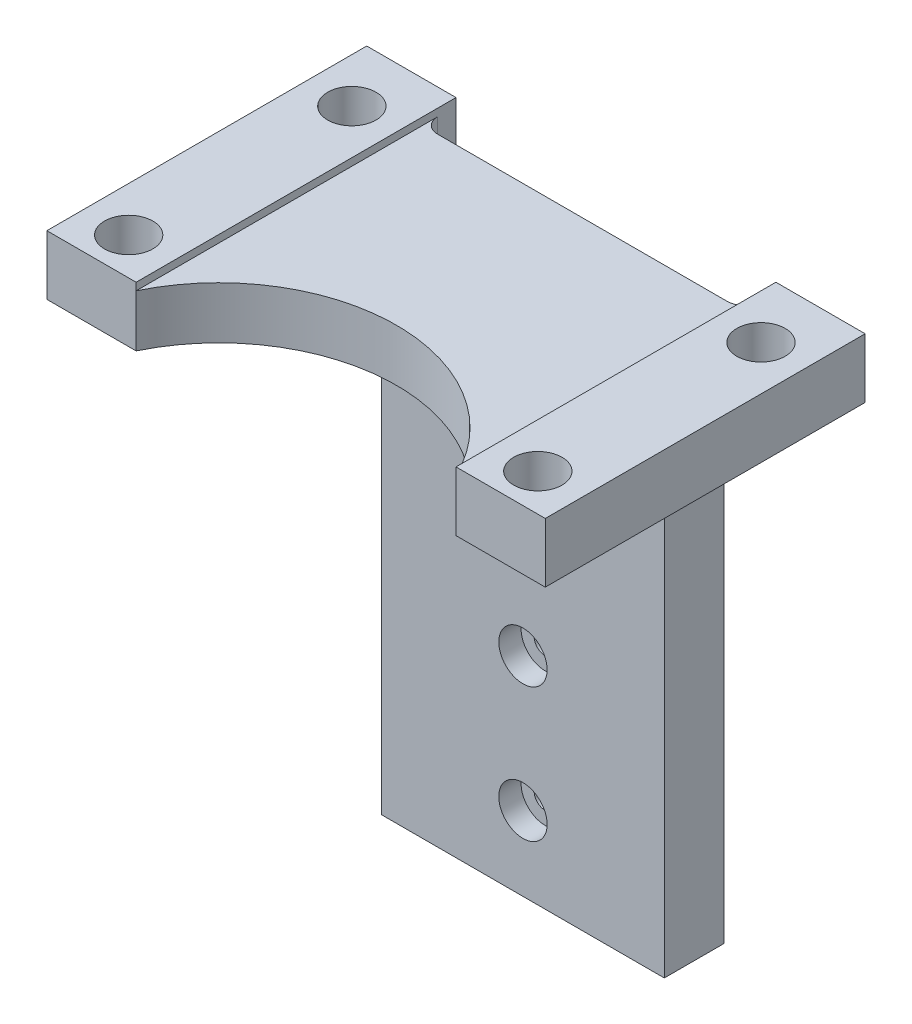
from build123d import *

# Parameters (mm, degrees)
ESQUISSE1_R             = 3.25
EXTRUSION1_DEPTH        = 8
ESQUISSE2_W             = 38
ESQUISSE2_H             = 8
EXTRUSION2_DEPTH        = 68
ESQUISSE3_R             = 3.25
ENL_V_MAT_EXTRU_1_DEPTH = 3
ESQUISSE4_R             = 1.5
ENL_V_MAT_EXTRU_2_DEPTH = 102.169412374
ESQUISSE5_W             = 43
ESQUISSE5_H             = 43
ENL_V_MAT_EXTRU_3_DEPTH = 1


with BuildPart() as part:
    # Esquisse1 → Extrusion1 (new body)
    with BuildSketch(Plane(origin=(0, 0, 0), x_dir=(1, 0, 0), z_dir=(0, 1, 0))):
        with BuildLine():
            Line((12, 43), (12, 40.5))
            ThreePointArc((12, 40.5), (12.585786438, 39.085786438), (14, 38.5))
            Line((14, 38.5), (53, 38.5))
            ThreePointArc((53, 38.5), (54.414213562, 39.085786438), (55, 40.5))
            Line((55, 40.5), (55, 43))
            Line((55, 43), (67, 43))
            Line((67, 43), (67, 0))
            Line((67, 0), (55, 0))
            ThreePointArc((55, 0), (33.5, 13.5), (12, 0))
            Line((12, 0), (0, 0))
            Line((0, 0), (0, 43))
            Line((0, 43), (12, 43))
        make_face()
        with Locations(Location((61, 5, 0), (0, 0, 270))):
            Circle(ESQUISSE1_R, mode=Mode.SUBTRACT)
        with Locations(Location((61, 35, 0), (0, 0, 270))):
            Circle(ESQUISSE1_R, mode=Mode.SUBTRACT)
        with Locations(Location((6, 5, 0), (0, 0, 270))):
            Circle(ESQUISSE1_R, mode=Mode.SUBTRACT)
        with Locations(Location((6, 35, 0), (0, 0, 270))):
            Circle(ESQUISSE1_R, mode=Mode.SUBTRACT)
    extrude(amount=EXTRUSION1_DEPTH)

    # Esquisse2 → Extrusion2 (add)
    with BuildSketch(Plane.XZ):
        with Locations((33.5, -34.5)):
            Rectangle(ESQUISSE2_W, ESQUISSE2_H)
    extrude(amount=EXTRUSION2_DEPTH)

    # Esquisse3 → Enl_v. mat.-Extru.1 (cut)
    with BuildSketch(Plane.XY.offset(-30.5)):
        with Locations((33.5, -58)):
            Circle(ESQUISSE3_R)
        with Locations((33.5, -40)):
            Circle(ESQUISSE3_R)
        with Locations((33.5, -22)):
            Circle(ESQUISSE3_R)
    extrude(amount=-ENL_V_MAT_EXTRU_1_DEPTH, mode=Mode.SUBTRACT)

    # Esquisse4 → Enl_v. mat.-Extru.2 (cut, through all)
    with BuildSketch(Plane.XY.offset(-33.5)):
        with Locations((33.5, -58)):
            Circle(ESQUISSE4_R)
        with Locations((33.5, -40)):
            Circle(ESQUISSE4_R)
        with Locations((33.5, -22)):
            Circle(ESQUISSE4_R)
    extrude(amount=-ENL_V_MAT_EXTRU_2_DEPTH, mode=Mode.SUBTRACT)

    # Esquisse5 → Enl_v. mat.-Extru.3 (cut)
    with BuildSketch(Plane(origin=(0, 8, 0), x_dir=(-1, 0, 0), z_dir=(0, 1, 0))):
        with Locations((-33.5, -21.5)):
            Rectangle(ESQUISSE5_W, ESQUISSE5_H)
    extrude(amount=-ENL_V_MAT_EXTRU_3_DEPTH, mode=Mode.SUBTRACT)


solid = part.part
